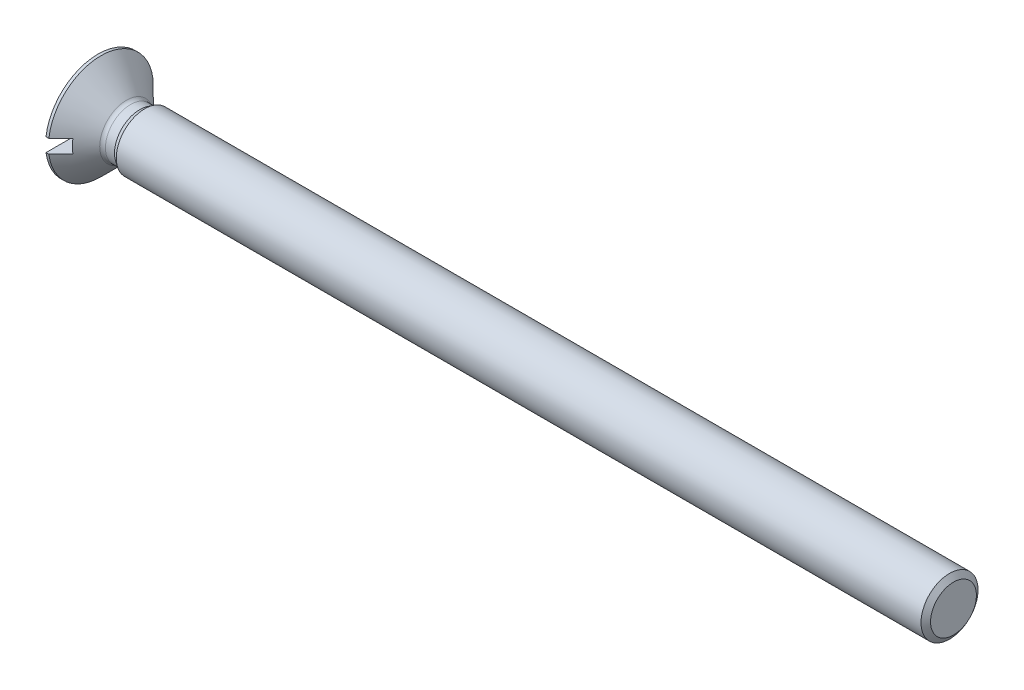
ISO-10303-21;
HEADER;
FILE_DESCRIPTION(('STEP AP214'),'2;1');
FILE_NAME('part.step','',(''),(''),'','','');
FILE_SCHEMA(('AUTOMOTIVE_DESIGN { 1 0 10303 214 1 1 1 1 }'));
ENDSEC;
DATA;
#1=APPLICATION_CONTEXT('core data for automotive mechanical design processes');
#2=APPLICATION_PROTOCOL_DEFINITION('international standard','automotive_design',2000,#1);
#3=PRODUCT_CONTEXT('',#1,'mechanical');
#4=PRODUCT('Part','Part','',(#3));
#5=PRODUCT_RELATED_PRODUCT_CATEGORY('part','',(#4));
#6=PRODUCT_DEFINITION_FORMATION('','',#4);
#7=PRODUCT_DEFINITION_CONTEXT('part definition',#1,'design');
#8=PRODUCT_DEFINITION('design','',#6,#7);
#9=PRODUCT_DEFINITION_SHAPE('','',#8);
#10=(LENGTH_UNIT() NAMED_UNIT(*) SI_UNIT(.MILLI.,.METRE.));
#11=(NAMED_UNIT(*) PLANE_ANGLE_UNIT() SI_UNIT($,.RADIAN.));
#12=(NAMED_UNIT(*) SI_UNIT($,.STERADIAN.) SOLID_ANGLE_UNIT());
#13=UNCERTAINTY_MEASURE_WITH_UNIT(LENGTH_MEASURE(1.E-05),#10,'distance_accuracy_value','');
#14=(GEOMETRIC_REPRESENTATION_CONTEXT(3) GLOBAL_UNCERTAINTY_ASSIGNED_CONTEXT((#13)) GLOBAL_UNIT_ASSIGNED_CONTEXT((#10,
#11,#12)) REPRESENTATION_CONTEXT('',''));
#15=CARTESIAN_POINT('',(0.,0.,0.));
#16=DIRECTION('',(0.,0.,1.));
#17=DIRECTION('',(1.,0.,0.));
#18=AXIS2_PLACEMENT_3D('',#15,#16,#17);
#19=CARTESIAN_POINT('',(0.,0.,4.6));
#20=DIRECTION('',(1.,0.,0.));
#21=DIRECTION('',(0.,0.,-1.));
#22=AXIS2_PLACEMENT_3D('',#19,#20,#21);
#23=PLANE('',#22);
#24=DIRECTION('',(0.,0.,1.));
#25=VECTOR('',#24,1.);
#26=CARTESIAN_POINT('',(0.,-0.6,-4.56070170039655));
#27=LINE('',#26,#25);
#28=CARTESIAN_POINT('',(0.,-0.6,-4.56070170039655));
#29=VERTEX_POINT('',#28);
#30=CARTESIAN_POINT('',(0.,-0.6,4.56070170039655));
#31=VERTEX_POINT('',#30);
#32=EDGE_CURVE('E80',#29,#31,#27,.T.);
#33=ORIENTED_EDGE('',*,*,#32,.F.);
#34=CARTESIAN_POINT('',(0.,0.,0.));
#35=DIRECTION('',(-1.,0.,0.));
#36=DIRECTION('',(0.,-0.130434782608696,-0.991456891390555));
#37=AXIS2_PLACEMENT_3D('',#34,#35,#36);
#38=CIRCLE('',#37,4.6);
#39=EDGE_CURVE('E68',#29,#31,#38,.T.);
#40=ORIENTED_EDGE('',*,*,#39,.T.);
#41=EDGE_LOOP('',(#33,#40));
#42=FACE_BOUND('',#41,.T.);
#43=ADVANCED_FACE('F17',(#42),#23,.F.);
#44=CARTESIAN_POINT('',(-1.,-0.6,75.));
#45=DIRECTION('',(0.,1.,0.));
#46=DIRECTION('',(0.,0.,1.));
#47=AXIS2_PLACEMENT_3D('',#44,#45,#46);
#48=PLANE('',#47);
#49=CARTESIAN_POINT('',(0.2500000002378,-0.6,4.5607017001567));
#50=CARTESIAN_POINT('',(0.425212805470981,-0.6,4.38397913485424));
#51=CARTESIAN_POINT('',(0.600325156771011,-0.6,4.20718613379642));
#52=CARTESIAN_POINT('',(0.950358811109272,-0.6,3.85329473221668));
#53=CARTESIAN_POINT('',(1.1252810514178,-0.6,3.6761976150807));
#54=CARTESIAN_POINT('',(1.299999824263,-0.6,3.49892858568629));
#55=B_SPLINE_CURVE_WITH_KNOTS('',3,(#49,#50,#51,#52,#53,#54),.UNSPECIFIED.,.F.,.F.,(4,2,4),
(0.000993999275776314,0.747257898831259,1.49352179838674),.UNSPECIFIED.);
#56=CARTESIAN_POINT('',(0.25,-0.6,4.56070170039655));
#57=VERTEX_POINT('',#56);
#58=CARTESIAN_POINT('',(1.3,-0.6,3.49892840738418));
#59=VERTEX_POINT('',#58);
#60=EDGE_CURVE('E79',#57,#59,#55,.T.);
#61=ORIENTED_EDGE('',*,*,#60,.T.);
#62=DIRECTION('',(0.,0.,-1.));
#63=VECTOR('',#62,1.);
#64=CARTESIAN_POINT('',(1.3,-0.6,3.49892840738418));
#65=LINE('',#64,#63);
#66=CARTESIAN_POINT('',(1.3,-0.6,-3.49892840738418));
#67=VERTEX_POINT('',#66);
#68=EDGE_CURVE('E105',#59,#67,#65,.T.);
#69=ORIENTED_EDGE('',*,*,#68,.T.);
#70=CARTESIAN_POINT('',(1.30000370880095,-0.6,-3.49892464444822));
#71=CARTESIAN_POINT('',(1.21265193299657,-0.6,-3.58755144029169));
#72=CARTESIAN_POINT('',(1.12525263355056,-0.6,-3.67613073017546));
#73=CARTESIAN_POINT('',(0.950375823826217,-0.6,-3.85321462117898));
#74=CARTESIAN_POINT('',(0.862898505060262,-0.6,-3.9417189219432));
#75=CARTESIAN_POINT('',(0.600371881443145,-0.6,-4.20713894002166));
#76=CARTESIAN_POINT('',(0.425228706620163,-0.6,-4.38396309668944));
#77=CARTESIAN_POINT('',(0.250000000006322,-0.6,-4.56070170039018));
#78=B_SPLINE_CURVE_WITH_KNOTS('',3,(#70,#71,#72,#73,#74,#75,#76,#77),.UNSPECIFIED.,.F.,.F.,(4,2,
2,4),(10.7302075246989,11.1032160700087,11.4762246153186,12.2222417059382),.UNSPECIFIED.);
#79=CARTESIAN_POINT('',(0.25,-0.6,-4.56070170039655));
#80=VERTEX_POINT('',#79);
#81=EDGE_CURVE('E88',#67,#80,#78,.T.);
#82=ORIENTED_EDGE('',*,*,#81,.T.);
#83=DIRECTION('',(-1.,0.,0.));
#84=VECTOR('',#83,1.);
#85=CARTESIAN_POINT('',(0.25,-0.6,-4.56070170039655));
#86=LINE('',#85,#84);
#87=EDGE_CURVE('E72',#80,#29,#86,.T.);
#88=ORIENTED_EDGE('',*,*,#87,.T.);
#89=ORIENTED_EDGE('',*,*,#32,.T.);
#90=DIRECTION('',(1.,0.,0.));
#91=VECTOR('',#90,1.);
#92=CARTESIAN_POINT('',(0.,-0.6,4.56070170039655));
#93=LINE('',#92,#91);
#94=EDGE_CURVE('E74',#31,#57,#93,.T.);
#95=ORIENTED_EDGE('',*,*,#94,.T.);
#96=EDGE_LOOP('',(#61,#69,#82,#88,#89,#95));
#97=FACE_BOUND('',#96,.T.);
#98=ADVANCED_FACE('F85',(#97),#48,.T.);
#99=CARTESIAN_POINT('',(0.,0.,0.));
#100=DIRECTION('',(-1.,0.,0.));
#101=DIRECTION('',(0.,0.,1.));
#102=AXIS2_PLACEMENT_3D('',#99,#100,#101);
#103=CYLINDRICAL_SURFACE('',#102,4.6);
#104=ORIENTED_EDGE('',*,*,#87,.F.);
#105=CARTESIAN_POINT('',(0.25,0.,0.));
#106=DIRECTION('',(-1.,0.,0.));
#107=DIRECTION('',(0.,-0.130434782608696,-0.991456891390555));
#108=AXIS2_PLACEMENT_3D('',#105,#106,#107);
#109=CIRCLE('',#108,4.6);
#110=EDGE_CURVE('E131',#80,#57,#109,.T.);
#111=ORIENTED_EDGE('',*,*,#110,.T.);
#112=ORIENTED_EDGE('',*,*,#94,.F.);
#113=ORIENTED_EDGE('',*,*,#39,.F.);
#114=EDGE_LOOP('',(#104,#111,#112,#113));
#115=FACE_BOUND('',#114,.T.);
#116=ADVANCED_FACE('F70',(#115),#103,.T.);
#117=CARTESIAN_POINT('',(2.35,0.,0.));
#118=DIRECTION('',(-1.,0.,0.));
#119=DIRECTION('',(0.,0.,1.));
#120=AXIS2_PLACEMENT_3D('',#117,#118,#119);
#121=CONICAL_SURFACE('',#120,2.5,0.785398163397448);
#122=CARTESIAN_POINT('',(1.30000000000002,0.,0.));
#123=DIRECTION('',(-1.,0.,0.));
#124=DIRECTION('',(0.,-0.169014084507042,0.985613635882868));
#125=AXIS2_PLACEMENT_3D('',#122,#123,#124);
#126=CIRCLE('',#125,3.54999999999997);
#127=CARTESIAN_POINT('',(1.3,0.6,3.49892840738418));
#128=VERTEX_POINT('',#127);
#129=EDGE_CURVE('E136',#59,#128,#126,.T.);
#130=ORIENTED_EDGE('',*,*,#129,.F.);
#131=ORIENTED_EDGE('',*,*,#60,.F.);
#132=ORIENTED_EDGE('',*,*,#110,.F.);
#133=ORIENTED_EDGE('',*,*,#81,.F.);
#134=CARTESIAN_POINT('',(1.30000000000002,0.,0.));
#135=DIRECTION('',(-1.,0.,0.));
#136=DIRECTION('',(0.,0.169014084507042,-0.985613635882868));
#137=AXIS2_PLACEMENT_3D('',#134,#135,#136);
#138=CIRCLE('',#137,3.54999999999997);
#139=CARTESIAN_POINT('',(1.3,0.6,-3.49892840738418));
#140=VERTEX_POINT('',#139);
#141=EDGE_CURVE('E142',#140,#67,#138,.T.);
#142=ORIENTED_EDGE('',*,*,#141,.F.);
#143=CARTESIAN_POINT('',(0.250000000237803,0.6,-4.5607017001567));
#144=CARTESIAN_POINT('',(0.425212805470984,0.6,-4.38397913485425));
#145=CARTESIAN_POINT('',(0.600325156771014,0.6,-4.20718613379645));
#146=CARTESIAN_POINT('',(0.950358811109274,0.6,-3.85329473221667));
#147=CARTESIAN_POINT('',(1.1252810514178,0.6,-3.67619761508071));
#148=CARTESIAN_POINT('',(1.29999982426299,0.6,-3.4989285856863));
#149=B_SPLINE_CURVE_WITH_KNOTS('',3,(#143,#144,#145,#146,#147,#148),.UNSPECIFIED.,.F.,.F.,(4,2,
4),(0.000993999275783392,0.747257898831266,1.49352179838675),.UNSPECIFIED.);
#150=CARTESIAN_POINT('',(0.25,0.6,-4.56070170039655));
#151=VERTEX_POINT('',#150);
#152=EDGE_CURVE('E187',#151,#140,#149,.T.);
#153=ORIENTED_EDGE('',*,*,#152,.F.);
#154=CARTESIAN_POINT('',(0.25,0.,0.));
#155=DIRECTION('',(-1.,0.,0.));
#156=DIRECTION('',(0.,0.130434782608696,0.991456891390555));
#157=AXIS2_PLACEMENT_3D('',#154,#155,#156);
#158=CIRCLE('',#157,4.6);
#159=CARTESIAN_POINT('',(0.25,0.6,4.56070170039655));
#160=VERTEX_POINT('',#159);
#161=EDGE_CURVE('E178',#160,#151,#158,.T.);
#162=ORIENTED_EDGE('',*,*,#161,.F.);
#163=CARTESIAN_POINT('',(1.30000370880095,0.6,3.4989246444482));
#164=CARTESIAN_POINT('',(1.21265193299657,0.6,3.58755144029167));
#165=CARTESIAN_POINT('',(1.12525263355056,0.6,3.67613073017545));
#166=CARTESIAN_POINT('',(0.950375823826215,0.6,3.85321462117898));
#167=CARTESIAN_POINT('',(0.862898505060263,0.6,3.94171892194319));
#168=CARTESIAN_POINT('',(0.600371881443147,0.6,4.20713894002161));
#169=CARTESIAN_POINT('',(0.425228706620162,0.6,4.38396309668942));
#170=CARTESIAN_POINT('',(0.250000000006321,0.6,4.56070170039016));
#171=B_SPLINE_CURVE_WITH_KNOTS('',3,(#163,#164,#165,#166,#167,#168,#169,#170),.UNSPECIFIED.,.F.,
.F.,(4,2,2,4),(10.7302075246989,11.1032160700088,11.4762246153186,12.2222417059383),.UNSPECIFIED.);
#172=EDGE_CURVE('E186',#128,#160,#171,.T.);
#173=ORIENTED_EDGE('',*,*,#172,.F.);
#174=EDGE_LOOP('',(#130,#131,#132,#133,#142,#153,#162,#173));
#175=FACE_BOUND('',#174,.T.);
#176=CARTESIAN_POINT('',(2.4999997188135,0.,0.));
#177=DIRECTION('',(-1.,0.,0.));
#178=DIRECTION('',(0.,0.,1.));
#179=AXIS2_PLACEMENT_3D('',#176,#177,#178);
#180=CIRCLE('',#179,2.35);
#181=CARTESIAN_POINT('',(2.4999997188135,0.,2.35));
#182=VERTEX_POINT('',#181);
#183=EDGE_CURVE('E197',#182,#182,#180,.T.);
#184=ORIENTED_EDGE('',*,*,#183,.T.);
#185=EDGE_LOOP('',(#184));
#186=FACE_BOUND('',#185,.T.);
#187=ADVANCED_FACE('F152',(#175,#186),#121,.T.);
#188=CARTESIAN_POINT('',(1.3,-0.6,75.));
#189=DIRECTION('',(-1.,0.,0.));
#190=DIRECTION('',(0.,0.,1.));
#191=AXIS2_PLACEMENT_3D('',#188,#189,#190);
#192=PLANE('',#191);
#193=ORIENTED_EDGE('',*,*,#141,.T.);
#194=ORIENTED_EDGE('',*,*,#68,.F.);
#195=ORIENTED_EDGE('',*,*,#129,.T.);
#196=DIRECTION('',(0.,0.,-1.));
#197=VECTOR('',#196,1.);
#198=CARTESIAN_POINT('',(1.3,0.6,3.49892840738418));
#199=LINE('',#198,#197);
#200=EDGE_CURVE('E200',#128,#140,#199,.T.);
#201=ORIENTED_EDGE('',*,*,#200,.T.);
#202=EDGE_LOOP('',(#193,#194,#195,#201));
#203=FACE_BOUND('',#202,.T.);
#204=ADVANCED_FACE('F161',(#203),#192,.T.);
#205=CARTESIAN_POINT('',(1.3,0.6,75.));
#206=DIRECTION('',(0.,-1.,0.));
#207=DIRECTION('',(0.,0.,-1.));
#208=AXIS2_PLACEMENT_3D('',#205,#206,#207);
#209=PLANE('',#208);
#210=ORIENTED_EDGE('',*,*,#152,.T.);
#211=ORIENTED_EDGE('',*,*,#200,.F.);
#212=ORIENTED_EDGE('',*,*,#172,.T.);
#213=DIRECTION('',(-1.,0.,0.));
#214=VECTOR('',#213,1.);
#215=CARTESIAN_POINT('',(0.25,0.6,4.56070170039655));
#216=LINE('',#215,#214);
#217=CARTESIAN_POINT('',(0.,0.6,4.56070170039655));
#218=VERTEX_POINT('',#217);
#219=EDGE_CURVE('E214',#160,#218,#216,.T.);
#220=ORIENTED_EDGE('',*,*,#219,.T.);
#221=DIRECTION('',(0.,0.,-1.));
#222=VECTOR('',#221,1.);
#223=CARTESIAN_POINT('',(0.,0.6,4.56070170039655));
#224=LINE('',#223,#222);
#225=CARTESIAN_POINT('',(0.,0.6,-4.56070170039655));
#226=VERTEX_POINT('',#225);
#227=EDGE_CURVE('E35',#218,#226,#224,.T.);
#228=ORIENTED_EDGE('',*,*,#227,.T.);
#229=DIRECTION('',(1.,0.,0.));
#230=VECTOR('',#229,1.);
#231=CARTESIAN_POINT('',(0.,0.6,-4.56070170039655));
#232=LINE('',#231,#230);
#233=EDGE_CURVE('E219',#226,#151,#232,.T.);
#234=ORIENTED_EDGE('',*,*,#233,.T.);
#235=EDGE_LOOP('',(#210,#211,#212,#220,#228,#234));
#236=FACE_BOUND('',#235,.T.);
#237=ADVANCED_FACE('F253',(#236),#209,.T.);
#238=ORIENTED_EDGE('',*,*,#219,.F.);
#239=ORIENTED_EDGE('',*,*,#161,.T.);
#240=ORIENTED_EDGE('',*,*,#233,.F.);
#241=CARTESIAN_POINT('',(0.,0.,0.));
#242=DIRECTION('',(-1.,0.,0.));
#243=DIRECTION('',(0.,0.130434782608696,0.991456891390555));
#244=AXIS2_PLACEMENT_3D('',#241,#242,#243);
#245=CIRCLE('',#244,4.6);
#246=EDGE_CURVE('E32',#218,#226,#245,.T.);
#247=ORIENTED_EDGE('',*,*,#246,.F.);
#248=EDGE_LOOP('',(#238,#239,#240,#247));
#249=FACE_BOUND('',#248,.T.);
#250=ADVANCED_FACE('F262',(#249),#103,.T.);
#251=CARTESIAN_POINT('',(2.85355300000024,0.,0.));
#252=DIRECTION('',(-1.,0.,0.));
#253=DIRECTION('',(0.,0.,1.));
#254=AXIS2_PLACEMENT_3D('',#251,#252,#253);
#255=TOROIDAL_SURFACE('',#254,2.70355350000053,0.50000000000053);
#256=ORIENTED_EDGE('',*,*,#183,.F.);
#257=EDGE_LOOP('',(#256));
#258=FACE_BOUND('',#257,.T.);
#259=CARTESIAN_POINT('',(2.853553,0.,0.));
#260=DIRECTION('',(-1.,0.,0.));
#261=DIRECTION('',(0.,0.,1.));
#262=AXIS2_PLACEMENT_3D('',#259,#260,#261);
#263=CIRCLE('',#262,2.2035535);
#264=CARTESIAN_POINT('',(2.853553,0.,2.2035535));
#265=VERTEX_POINT('',#264);
#266=EDGE_CURVE('E225',#265,#265,#263,.T.);
#267=ORIENTED_EDGE('',*,*,#266,.T.);
#268=EDGE_LOOP('',(#267));
#269=FACE_BOUND('',#268,.T.);
#270=ADVANCED_FACE('F263',(#258,#269),#255,.F.);
#271=ORIENTED_EDGE('',*,*,#227,.F.);
#272=ORIENTED_EDGE('',*,*,#246,.T.);
#273=EDGE_LOOP('',(#271,#272));
#274=FACE_BOUND('',#273,.T.);
#275=ADVANCED_FACE('F283',(#274),#23,.F.);
#276=CARTESIAN_POINT('',(2.35,0.,0.));
#277=DIRECTION('',(-1.,0.,0.));
#278=DIRECTION('',(0.,0.,1.));
#279=AXIS2_PLACEMENT_3D('',#276,#277,#278);
#280=CYLINDRICAL_SURFACE('',#279,2.2035535);
#281=ORIENTED_EDGE('',*,*,#266,.F.);
#282=EDGE_LOOP('',(#281));
#283=FACE_BOUND('',#282,.T.);
#284=CARTESIAN_POINT('',(3.64966544,0.,0.));
#285=DIRECTION('',(-1.,0.,0.));
#286=DIRECTION('',(0.,0.,1.));
#287=AXIS2_PLACEMENT_3D('',#284,#285,#286);
#288=CIRCLE('',#287,2.2035535);
#289=CARTESIAN_POINT('',(3.64966544,0.,2.2035535));
#290=VERTEX_POINT('',#289);
#291=EDGE_CURVE('E229',#290,#290,#288,.T.);
#292=ORIENTED_EDGE('',*,*,#291,.T.);
#293=EDGE_LOOP('',(#292));
#294=FACE_BOUND('',#293,.T.);
#295=ADVANCED_FACE('F290',(#283,#294),#280,.T.);
#296=CARTESIAN_POINT('',(4.1,0.,0.));
#297=DIRECTION('',(1.,0.,0.));
#298=DIRECTION('',(0.,0.,-1.));
#299=AXIS2_PLACEMENT_3D('',#296,#297,#298);
#300=CONICAL_SURFACE('',#299,2.5,0.58217436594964);
#301=ORIENTED_EDGE('',*,*,#291,.F.);
#302=EDGE_LOOP('',(#301));
#303=FACE_BOUND('',#302,.T.);
#304=CARTESIAN_POINT('',(4.1,0.,0.));
#305=DIRECTION('',(-1.,0.,0.));
#306=DIRECTION('',(0.,0.,1.));
#307=AXIS2_PLACEMENT_3D('',#304,#305,#306);
#308=CIRCLE('',#307,2.5);
#309=CARTESIAN_POINT('',(4.1,0.,2.5));
#310=VERTEX_POINT('',#309);
#311=EDGE_CURVE('E233',#310,#310,#308,.T.);
#312=ORIENTED_EDGE('',*,*,#311,.T.);
#313=EDGE_LOOP('',(#312));
#314=FACE_BOUND('',#313,.T.);
#315=ADVANCED_FACE('F294',(#303,#314),#300,.T.);
#316=CARTESIAN_POINT('',(0.,0.,0.));
#317=DIRECTION('',(-1.,0.,0.));
#318=DIRECTION('',(0.,0.,1.));
#319=AXIS2_PLACEMENT_3D('',#316,#317,#318);
#320=CYLINDRICAL_SURFACE('',#319,2.5);
#321=ORIENTED_EDGE('',*,*,#311,.F.);
#322=EDGE_LOOP('',(#321));
#323=FACE_BOUND('',#322,.T.);
#324=CARTESIAN_POINT('',(74.653164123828,0.,0.));
#325=DIRECTION('',(-1.,0.,0.));
#326=DIRECTION('',(0.,0.,1.));
#327=AXIS2_PLACEMENT_3D('',#324,#325,#326);
#328=CIRCLE('',#327,2.49999999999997);
#329=CARTESIAN_POINT('',(74.653164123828,0.,2.5));
#330=VERTEX_POINT('',#329);
#331=EDGE_CURVE('E26',#330,#330,#328,.T.);
#332=ORIENTED_EDGE('',*,*,#331,.T.);
#333=EDGE_LOOP('',(#332));
#334=FACE_BOUND('',#333,.T.);
#335=ADVANCED_FACE('F299',(#323,#334),#320,.T.);
#336=CARTESIAN_POINT('',(75.,0.,0.));
#337=DIRECTION('',(-1.,0.,0.));
#338=DIRECTION('',(0.,0.,1.));
#339=AXIS2_PLACEMENT_3D('',#336,#337,#338);
#340=CONICAL_SURFACE('',#339,2.00949999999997,0.955316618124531);
#341=ORIENTED_EDGE('',*,*,#331,.F.);
#342=EDGE_LOOP('',(#341));
#343=FACE_BOUND('',#342,.T.);
#344=CARTESIAN_POINT('',(75.,0.,0.));
#345=DIRECTION('',(-1.,0.,0.));
#346=DIRECTION('',(0.,0.,1.));
#347=AXIS2_PLACEMENT_3D('',#344,#345,#346);
#348=CIRCLE('',#347,2.00949999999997);
#349=CARTESIAN_POINT('',(75.,0.,2.0095));
#350=VERTEX_POINT('',#349);
#351=EDGE_CURVE('E11',#350,#350,#348,.T.);
#352=ORIENTED_EDGE('',*,*,#351,.T.);
#353=EDGE_LOOP('',(#352));
#354=FACE_BOUND('',#353,.T.);
#355=ADVANCED_FACE('F306',(#343,#354),#340,.T.);
#356=CARTESIAN_POINT('',(75.,0.,0.));
#357=DIRECTION('',(-1.,0.,0.));
#358=DIRECTION('',(0.,0.,1.));
#359=AXIS2_PLACEMENT_3D('',#356,#357,#358);
#360=PLANE('',#359);
#361=ORIENTED_EDGE('',*,*,#351,.F.);
#362=EDGE_LOOP('',(#361));
#363=FACE_BOUND('',#362,.T.);
#364=ADVANCED_FACE('F19',(#363),#360,.F.);
#365=CLOSED_SHELL('',(#43,#98,#116,#187,#204,#237,#250,#270,#275,#295,#315,#335,#355,#364));
#366=MANIFOLD_SOLID_BREP('B1',#365);
#367=ADVANCED_BREP_SHAPE_REPRESENTATION('',(#18,#366),#14);
#368=SHAPE_DEFINITION_REPRESENTATION(#9,#367);
ENDSEC;
END-ISO-10303-21;
